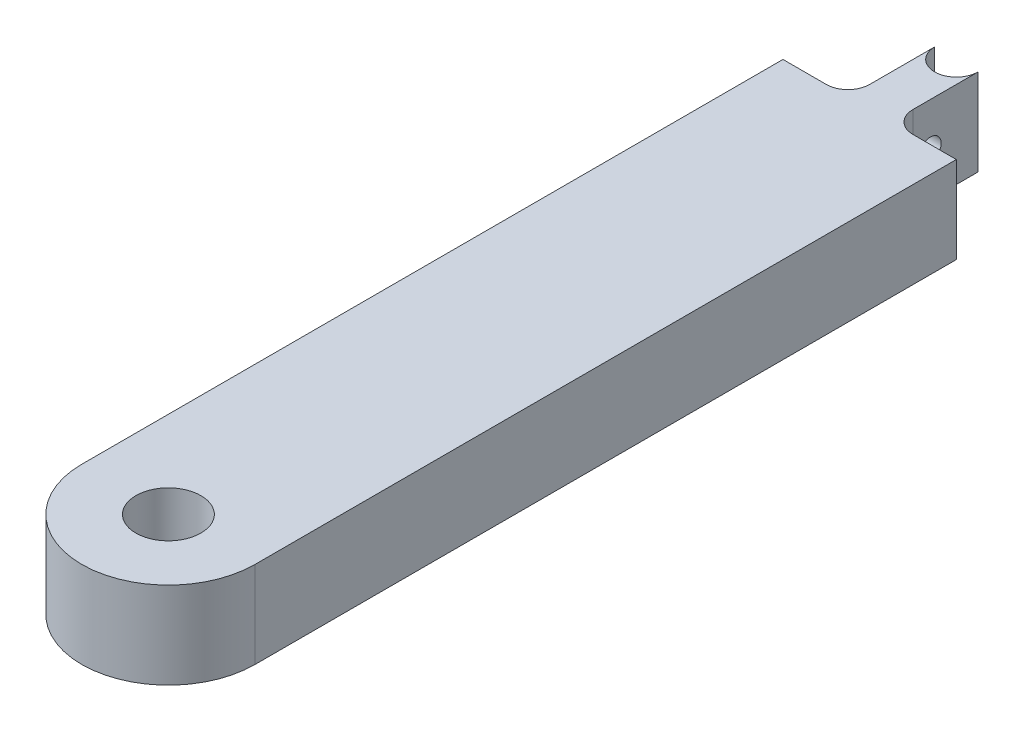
from build123d import *

# Parameters (mm, degrees)
SKETCH1_R           = 6.35
BOSS_EXTRUDE1_DEPTH = 25.4
FILLET4_R           = 6.35
SKETCH4_R           = 3.175
CUT_EXTRUDE4_DEPTH  = 64.008
SKETCH5_R           = 9.525
CUT_EXTRUDE5_DEPTH  = 64.008


with BuildPart() as part:
    # Sketch1 → Boss-Extrude1 (new body)
    with BuildSketch(Plane(origin=(0, 0, 0), x_dir=(1, 0, 0), z_dir=(0, 1, 0))):
        with BuildLine():
            Line((-25.4, 199.136), (-25.4, 0))
            ThreePointArc((-25.4, 0), (0, -25.4), (25.4, 0))
            Line((25.4, 0), (25.4, 199.136))
            Line((25.4, 199.136), (25.4, 205.486))
            Line((25.4, 205.486), (6.35, 205.486))
            Line((6.35, 205.486), (6.35, 230.886))
            ThreePointArc((6.35, 230.886), (4.490128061, 226.395871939), (0, 224.536))
            ThreePointArc((0, 224.536), (-4.490128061, 226.395871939), (-6.35, 230.886))
            Line((-6.35, 230.886), (-6.35, 205.486))
            Line((-6.35, 205.486), (-25.4, 205.486))
            Line((-25.4, 205.486), (-25.4, 199.136))
        make_face()
        with Locations(Location((0, 0, 0), (0, 0, 270))):
            Circle(SKETCH1_R, mode=Mode.SUBTRACT)
    extrude(amount=BOSS_EXTRUDE1_DEPTH)

    # Fillet4
    fillet4_edges = [part.edges().sort_by_distance(p)[0] for p in [
        (6.35, 12.7, -205.486),
        (-6.35, 12.7, -205.486),
    ]]
    fillet(fillet4_edges, radius=FILLET4_R)

    # Sketch4 → Cut-Extrude4 (cut)
    with BuildSketch(Plane.ZY.offset(6.35)):
        with Locations((-216.916, 12.699999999)):
            Circle(SKETCH4_R)
    extrude(amount=-CUT_EXTRUDE4_DEPTH, mode=Mode.SUBTRACT)

    # Sketch5 → Cut-Extrude5 (cut)
    with BuildSketch(Plane.XZ):
        with Locations(Location((0, 0, 0), (0, 0, 270))):
            Circle(SKETCH5_R)
    extrude(amount=-CUT_EXTRUDE5_DEPTH, mode=Mode.SUBTRACT)


solid = part.part
